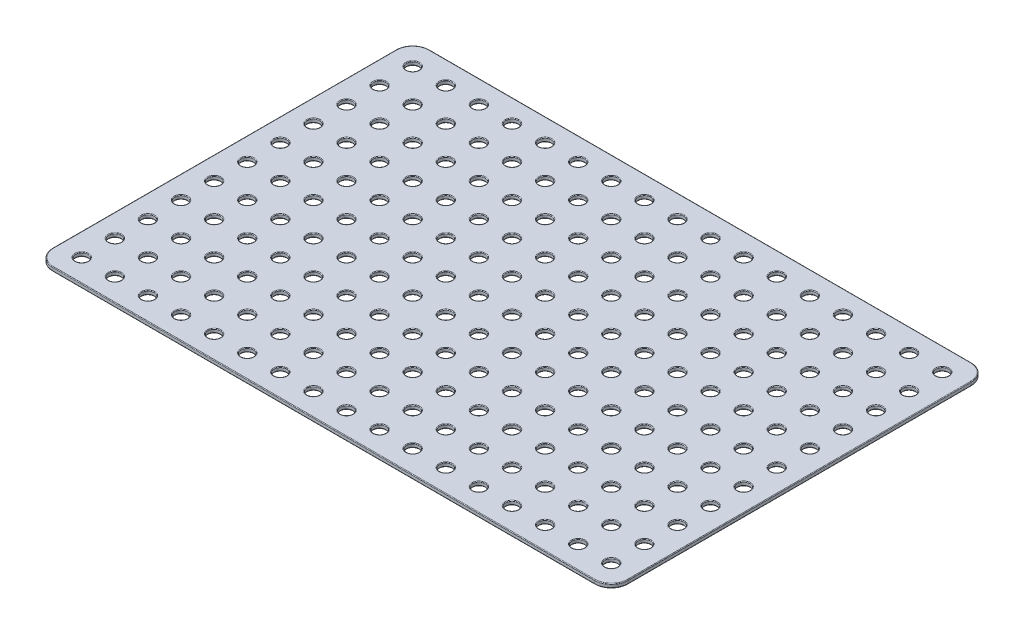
from build123d import *

# Parameters (mm, degrees)
EXTRUDE1_DEPTH       = 1.524
SKETCH2_R            = 2.413
CUT_EXTRUDE1_DEPTH   = 264.766847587
LPATTERN1_COUNT      = 17
LPATTERN1_PITCH      = 12.7
LPATTERN1_COUNT_DIR2 = 11
LPATTERN1_PITCH_DIR2 = 12.7
FILLET1_R            = 0.254


with BuildPart() as part:
    # Sketch1 → Extrude1 (new body)
    with BuildSketch(Plane(origin=(0, 0, 0), x_dir=(1, 0, 0), z_dir=(0, 1, 0))):
        with BuildLine():
            Line((6.35, 0), (214.3252, 0))
            ThreePointArc((214.3252, 0), (218.815328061, 1.859871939), (220.6752, 6.35))
            Line((220.6752, 6.35), (220.6752, 138.1252))
            ThreePointArc((220.6752, 138.1252), (218.815328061, 142.615328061), (214.3252, 144.4752))
            Line((214.3252, 144.4752), (6.35, 144.4752))
            ThreePointArc((6.35, 144.4752), (1.859871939, 142.615328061), (0, 138.1252))
            Line((0, 138.1252), (0, 6.35))
            ThreePointArc((0, 6.35), (1.859871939, 1.859871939), (6.35, 0))
        make_face()
    extrude(amount=EXTRUDE1_DEPTH)

    # Sketch2 → Cut-Extrude1 (cut, through all)
    with BuildSketch(Plane(origin=(0, 1.524, 0), x_dir=(-1, 0, 0), z_dir=(0, 1, 0))):
        with Locations(Location((-8.7376, -8.7376, 0), (0, 0, 90))):
            Circle(SKETCH2_R)
    cut_extrude1 = extrude(amount=-CUT_EXTRUDE1_DEPTH, mode=Mode.SUBTRACT)

    # LPattern1: Cut-Extrude1 17 × 11
    with Locations(*[(i * LPATTERN1_PITCH, 0, -j * LPATTERN1_PITCH_DIR2) for i in range(LPATTERN1_COUNT) for j in range(LPATTERN1_COUNT_DIR2) if (i, j) != (0, 0)]):
        add(cut_extrude1, mode=Mode.SUBTRACT)

    # Fillet1
    fillet1_edges = [part.edges().sort_by_distance(p)[0] for p in [
        (1.859871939, 1.524, -1.859871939),
        (199.2376, 0, -49.2506),
        (199.2376, 1.524, -49.2506),
        (21.4376, 0, -61.9506),
        (21.4376, 1.524, -61.9506),
        (34.1376, 0, -61.9506),
        (34.1376, 1.524, -61.9506),
        (46.8376, 0, -61.9506),
        (46.8376, 1.524, -61.9506),
        (59.5376, 0, -61.9506),
        (59.5376, 1.524, -61.9506),
        (72.2376, 0, -61.9506),
        (72.2376, 1.524, -61.9506),
        (84.9376, 0, -61.9506),
        (84.9376, 1.524, -61.9506),
        (97.6376, 0, -61.9506),
        (97.6376, 1.524, -61.9506),
        (110.3376, 0, -61.9506),
        (110.3376, 1.524, -61.9506),
        (123.0376, 0, -61.9506),
        (123.0376, 1.524, -61.9506),
        (135.7376, 0, -61.9506),
        (135.7376, 1.524, -61.9506),
        (148.4376, 0, -61.9506),
        (148.4376, 1.524, -61.9506),
        (161.1376, 0, -61.9506),
        (161.1376, 1.524, -61.9506),
        (173.8376, 0, -61.9506),
        (173.8376, 1.524, -61.9506),
        (186.5376, 0, -61.9506),
        (186.5376, 1.524, -61.9506),
        (199.2376, 0, -61.9506),
        (199.2376, 1.524, -61.9506),
        (21.4376, 0, -74.6506),
        (21.4376, 1.524, -74.6506),
        (34.1376, 0, -74.6506),
        (34.1376, 1.524, -74.6506),
        (46.8376, 0, -74.6506),
        (46.8376, 1.524, -74.6506),
        (110.3376, 1.524, 0),
        (59.5376, 0, -74.6506),
        (59.5376, 1.524, -74.6506),
        (72.2376, 0, -74.6506),
        (72.2376, 1.524, -74.6506),
        (84.9376, 0, -74.6506),
        (84.9376, 1.524, -74.6506),
        (97.6376, 0, -74.6506),
        (97.6376, 1.524, -74.6506),
        (110.3376, 0, -74.6506),
        (110.3376, 1.524, -74.6506),
        (123.0376, 0, -74.6506),
        (123.0376, 1.524, -74.6506),
        (135.7376, 0, -74.6506),
        (135.7376, 1.524, -74.6506),
        (148.4376, 0, -74.6506),
        (148.4376, 1.524, -74.6506),
        (161.1376, 0, -74.6506),
        (161.1376, 1.524, -74.6506),
        (173.8376, 0, -74.6506),
        (173.8376, 1.524, -74.6506),
        (186.5376, 0, -74.6506),
        (186.5376, 1.524, -74.6506),
        (199.2376, 0, -74.6506),
        (199.2376, 1.524, -74.6506),
        (21.4376, 0, -87.3506),
        (21.4376, 1.524, -87.3506),
        (34.1376, 0, -87.3506),
        (34.1376, 1.524, -87.3506),
        (46.8376, 0, -87.3506),
        (46.8376, 1.524, -87.3506),
        (59.5376, 0, -87.3506),
        (59.5376, 1.524, -87.3506),
        (72.2376, 0, -87.3506),
        (72.2376, 1.524, -87.3506),
        (84.9376, 0, -87.3506),
        (84.9376, 1.524, -87.3506),
        (97.6376, 0, -87.3506),
        (97.6376, 1.524, -87.3506),
        (218.815328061, 1.524, -1.859871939),
        (110.3376, 0, -87.3506),
        (110.3376, 1.524, -87.3506),
        (123.0376, 0, -87.3506),
        (123.0376, 1.524, -87.3506),
        (135.7376, 0, -87.3506),
        (135.7376, 1.524, -87.3506),
        (148.4376, 0, -87.3506),
        (148.4376, 1.524, -87.3506),
        (161.1376, 0, -87.3506),
        (161.1376, 1.524, -87.3506),
        (173.8376, 0, -87.3506),
        (173.8376, 1.524, -87.3506),
        (186.5376, 0, -87.3506),
        (186.5376, 1.524, -87.3506),
        (199.2376, 0, -87.3506),
        (199.2376, 1.524, -87.3506),
        (21.4376, 0, -100.0506),
        (21.4376, 1.524, -100.0506),
        (34.1376, 0, -100.0506),
        (34.1376, 1.524, -100.0506),
        (46.8376, 0, -100.0506),
        (46.8376, 1.524, -100.0506),
        (59.5376, 0, -100.0506),
        (59.5376, 1.524, -100.0506),
        (72.2376, 0, -100.0506),
        (72.2376, 1.524, -100.0506),
        (84.9376, 0, -100.0506),
        (84.9376, 1.524, -100.0506),
        (97.6376, 0, -100.0506),
        (97.6376, 1.524, -100.0506),
        (110.3376, 0, -100.0506),
        (110.3376, 1.524, -100.0506),
        (123.0376, 0, -100.0506),
        (123.0376, 1.524, -100.0506),
        (135.7376, 0, -100.0506),
        (135.7376, 1.524, -100.0506),
        (148.4376, 0, -100.0506),
        (148.4376, 1.524, -100.0506),
        (220.6752, 1.524, -72.2376),
        (161.1376, 0, -100.0506),
        (161.1376, 1.524, -100.0506),
        (173.8376, 0, -100.0506),
        (173.8376, 1.524, -100.0506),
        (186.5376, 0, -100.0506),
        (186.5376, 1.524, -100.0506),
        (199.2376, 0, -100.0506),
        (199.2376, 1.524, -100.0506),
        (21.4376, 0, -112.7506),
        (21.4376, 1.524, -112.7506),
        (34.1376, 0, -112.7506),
        (34.1376, 1.524, -112.7506),
        (46.8376, 0, -112.7506),
        (46.8376, 1.524, -112.7506),
        (59.5376, 0, -112.7506),
        (59.5376, 1.524, -112.7506),
        (72.2376, 0, -112.7506),
        (72.2376, 1.524, -112.7506),
        (84.9376, 0, -112.7506),
        (84.9376, 1.524, -112.7506),
        (97.6376, 0, -112.7506),
        (97.6376, 1.524, -112.7506),
        (110.3376, 0, -112.7506),
        (110.3376, 1.524, -112.7506),
        (123.0376, 0, -112.7506),
        (123.0376, 1.524, -112.7506),
        (135.7376, 0, -112.7506),
        (135.7376, 1.524, -112.7506),
        (148.4376, 0, -112.7506),
        (148.4376, 1.524, -112.7506),
        (161.1376, 0, -112.7506),
        (161.1376, 1.524, -112.7506),
        (173.8376, 0, -112.7506),
        (173.8376, 1.524, -112.7506),
        (186.5376, 0, -112.7506),
        (186.5376, 1.524, -112.7506),
        (218.815328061, 1.524, -142.615328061),
        (199.2376, 0, -112.7506),
        (199.2376, 1.524, -112.7506),
        (21.4376, 0, -125.4506),
        (21.4376, 1.524, -125.4506),
        (34.1376, 0, -125.4506),
        (34.1376, 1.524, -125.4506),
        (46.8376, 0, -125.4506),
        (46.8376, 1.524, -125.4506),
        (59.5376, 0, -125.4506),
        (59.5376, 1.524, -125.4506),
        (72.2376, 0, -125.4506),
        (72.2376, 1.524, -125.4506),
        (84.9376, 0, -125.4506),
        (84.9376, 1.524, -125.4506),
        (97.6376, 0, -125.4506),
        (97.6376, 1.524, -125.4506),
        (110.3376, 0, -125.4506),
        (110.3376, 1.524, -125.4506),
        (123.0376, 0, -125.4506),
        (123.0376, 1.524, -125.4506),
        (135.7376, 0, -125.4506),
        (135.7376, 1.524, -125.4506),
        (148.4376, 0, -125.4506),
        (148.4376, 1.524, -125.4506),
        (161.1376, 0, -125.4506),
        (161.1376, 1.524, -125.4506),
        (173.8376, 0, -125.4506),
        (173.8376, 1.524, -125.4506),
        (8.7376, 0, -11.1506),
        (186.5376, 0, -125.4506),
        (186.5376, 1.524, -125.4506),
        (199.2376, 0, -125.4506),
        (199.2376, 1.524, -125.4506),
        (8.7376, 1.524, -11.1506),
        (110.3376, 1.524, -144.4752),
        (8.7376, 0, -23.8506),
        (8.7376, 1.524, -23.8506),
        (8.7376, 0, -36.5506),
        (8.7376, 1.524, -36.5506),
        (8.7376, 0, -49.2506),
        (8.7376, 1.524, -49.2506),
        (8.7376, 0, -61.9506),
        (8.7376, 1.524, -61.9506),
        (21.4376, 1.524, -23.8506),
        (21.4376, 0, -23.8506),
        (8.7376, 0, -74.6506),
        (8.7376, 1.524, -74.6506),
        (8.7376, 0, -87.3506),
        (8.7376, 1.524, -87.3506),
        (8.7376, 0, -100.0506),
        (8.7376, 1.524, -100.0506),
        (8.7376, 0, -112.7506),
        (8.7376, 1.524, -112.7506),
        (8.7376, 0, -125.4506),
        (8.7376, 1.524, -125.4506),
        (8.7376, 0, -138.1506),
        (8.7376, 1.524, -138.1506),
        (21.4376, 0, -11.1506),
        (21.4376, 1.524, -11.1506),
        (34.1376, 0, -23.8506),
        (34.1376, 1.524, -23.8506),
        (21.4376, 0, -138.1506),
        (21.4376, 1.524, -138.1506),
        (34.1376, 0, -11.1506),
        (34.1376, 1.524, -11.1506),
        (34.1376, 0, -138.1506),
        (34.1376, 1.524, -138.1506),
        (46.8376, 0, -11.1506),
        (46.8376, 1.524, -11.1506),
        (46.8376, 0, -23.8506),
        (46.8376, 1.524, -23.8506),
        (46.8376, 0, -138.1506),
        (46.8376, 1.524, -138.1506),
        (59.5376, 0, -11.1506),
        (59.5376, 1.524, -11.1506),
        (59.5376, 0, -138.1506),
        (59.5376, 1.524, -138.1506),
        (72.2376, 0, -11.1506),
        (72.2376, 1.524, -11.1506),
        (59.5376, 0, -23.8506),
        (72.2376, 0, -138.1506),
        (72.2376, 1.524, -138.1506),
        (59.5376, 1.524, -23.8506),
        (84.9376, 0, -11.1506),
        (84.9376, 1.524, -11.1506),
        (84.9376, 0, -138.1506),
        (84.9376, 1.524, -138.1506),
        (97.6376, 0, -11.1506),
        (97.6376, 1.524, -11.1506),
        (72.2376, 0, -23.8506),
        (97.6376, 0, -138.1506),
        (97.6376, 1.524, -138.1506),
        (72.2376, 1.524, -23.8506),
        (110.3376, 0, -11.1506),
        (110.3376, 1.524, -11.1506),
        (110.3376, 0, -138.1506),
        (110.3376, 1.524, -138.1506),
        (123.0376, 0, -11.1506),
        (123.0376, 1.524, -11.1506),
        (123.0376, 0, -138.1506),
        (84.9376, 0, -23.8506),
        (123.0376, 1.524, -138.1506),
        (84.9376, 1.524, -23.8506),
        (135.7376, 0, -11.1506),
        (135.7376, 1.524, -11.1506),
        (135.7376, 0, -138.1506),
        (135.7376, 1.524, -138.1506),
        (148.4376, 0, -11.1506),
        (148.4376, 1.524, -11.1506),
        (148.4376, 0, -138.1506),
        (148.4376, 1.524, -138.1506),
        (97.6376, 0, -23.8506),
        (97.6376, 1.524, -23.8506),
        (161.1376, 0, -11.1506),
        (161.1376, 1.524, -11.1506),
        (161.1376, 0, -138.1506),
        (161.1376, 1.524, -138.1506),
        (1.859871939, 1.524, -142.615328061),
        (173.8376, 0, -11.1506),
        (173.8376, 1.524, -11.1506),
        (173.8376, 0, -138.1506),
        (173.8376, 1.524, -138.1506),
        (110.3376, 0, -23.8506),
        (186.5376, 0, -11.1506),
        (110.3376, 1.524, -23.8506),
        (186.5376, 1.524, -11.1506),
        (186.5376, 0, -138.1506),
        (186.5376, 1.524, -138.1506),
        (199.2376, 0, -11.1506),
        (199.2376, 1.524, -11.1506),
        (199.2376, 0, -138.1506),
        (199.2376, 1.524, -138.1506),
        (123.0376, 0, -23.8506),
        (211.9376, 0, -11.1506),
        (211.9376, 1.524, -11.1506),
        (123.0376, 1.524, -23.8506),
        (211.9376, 0, -23.8506),
        (211.9376, 1.524, -23.8506),
        (211.9376, 0, -36.5506),
        (211.9376, 1.524, -36.5506),
        (211.9376, 0, -49.2506),
        (211.9376, 1.524, -49.2506),
        (135.7376, 0, -23.8506),
        (211.9376, 0, -61.9506),
        (211.9376, 1.524, -61.9506),
        (135.7376, 1.524, -23.8506),
        (211.9376, 0, -74.6506),
        (211.9376, 1.524, -74.6506),
        (211.9376, 0, -87.3506),
        (211.9376, 1.524, -87.3506),
        (211.9376, 0, -100.0506),
        (211.9376, 1.524, -100.0506),
        (211.9376, 0, -112.7506),
        (211.9376, 1.524, -112.7506),
        (148.4376, 0, -23.8506),
        (148.4376, 1.524, -23.8506),
        (211.9376, 0, -125.4506),
        (211.9376, 1.524, -125.4506),
        (211.9376, 0, -138.1506),
        (211.9376, 1.524, -138.1506),
        (161.1376, 0, -23.8506),
        (161.1376, 1.524, -23.8506),
        (173.8376, 0, -23.8506),
        (173.8376, 1.524, -23.8506),
        (186.5376, 0, -23.8506),
        (186.5376, 1.524, -23.8506),
        (199.2376, 0, -23.8506),
        (199.2376, 1.524, -23.8506),
        (21.4376, 0, -36.5506),
        (21.4376, 1.524, -36.5506),
        (34.1376, 0, -36.5506),
        (34.1376, 1.524, -36.5506),
        (46.8376, 0, -36.5506),
        (46.8376, 1.524, -36.5506),
        (59.5376, 0, -36.5506),
        (59.5376, 1.524, -36.5506),
        (72.2376, 0, -36.5506),
        (72.2376, 1.524, -36.5506),
        (84.9376, 0, -36.5506),
        (84.9376, 1.524, -36.5506),
        (97.6376, 0, -36.5506),
        (97.6376, 1.524, -36.5506),
        (110.3376, 0, -36.5506),
        (110.3376, 1.524, -36.5506),
        (123.0376, 0, -36.5506),
        (123.0376, 1.524, -36.5506),
        (135.7376, 0, -36.5506),
        (135.7376, 1.524, -36.5506),
        (110.3376, 0, -144.4752),
        (148.4376, 0, -36.5506),
        (148.4376, 1.524, -36.5506),
        (0, 1.524, -72.2376),
        (161.1376, 0, -36.5506),
        (161.1376, 1.524, -36.5506),
        (173.8376, 0, -36.5506),
        (218.815328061, 0, -142.615328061),
        (173.8376, 1.524, -36.5506),
        (186.5376, 0, -36.5506),
        (186.5376, 1.524, -36.5506),
        (199.2376, 0, -36.5506),
        (199.2376, 1.524, -36.5506),
        (220.6752, 0, -72.2376),
        (21.4376, 0, -49.2506),
        (21.4376, 1.524, -49.2506),
        (34.1376, 0, -49.2506),
        (34.1376, 1.524, -49.2506),
        (46.8376, 0, -49.2506),
        (218.815328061, 0, -1.859871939),
        (46.8376, 1.524, -49.2506),
        (59.5376, 0, -49.2506),
        (59.5376, 1.524, -49.2506),
        (72.2376, 0, -49.2506),
        (72.2376, 1.524, -49.2506),
        (110.3376, 0, 0),
        (84.9376, 0, -49.2506),
        (84.9376, 1.524, -49.2506),
        (97.6376, 0, -49.2506),
        (97.6376, 1.524, -49.2506),
        (110.3376, 0, -49.2506),
        (1.859871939, 0, -1.859871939),
        (110.3376, 1.524, -49.2506),
        (123.0376, 0, -49.2506),
        (123.0376, 1.524, -49.2506),
        (135.7376, 0, -49.2506),
        (135.7376, 1.524, -49.2506),
        (0, 0, -72.2376),
        (148.4376, 0, -49.2506),
        (148.4376, 1.524, -49.2506),
        (161.1376, 0, -49.2506),
        (161.1376, 1.524, -49.2506),
        (173.8376, 0, -49.2506),
        (1.859871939, 0, -142.615328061),
        (173.8376, 1.524, -49.2506),
        (186.5376, 0, -49.2506),
        (186.5376, 1.524, -49.2506),
    ]]
    fillet(fillet1_edges, radius=FILLET1_R)


solid = part.part
